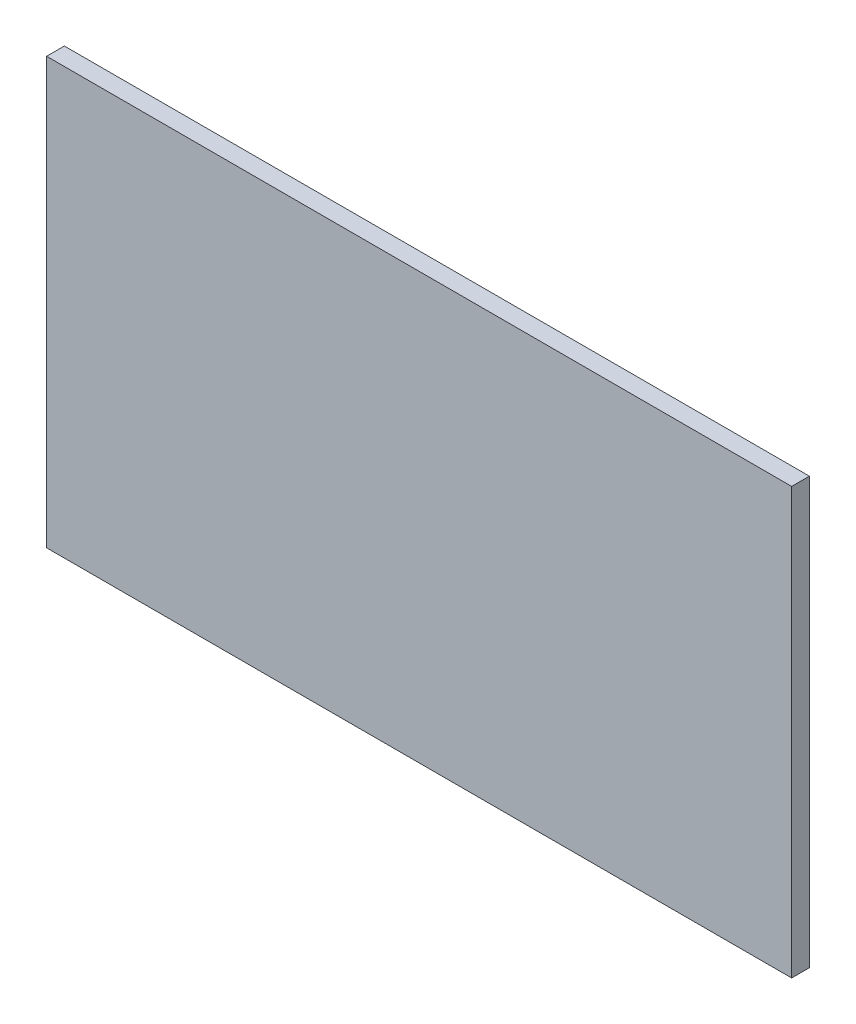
from build123d import *

# Parameters (mm, degrees)
SKETCH1_W           = 266.7
SKETCH1_H           = 152.4
BOSS_EXTRUDE1_DEPTH = 6.35


with BuildPart() as part:
    # Sketch1 → Boss-Extrude1 (new body)
    with BuildSketch(Plane.XY):
        Rectangle(SKETCH1_W, SKETCH1_H)
    extrude(amount=BOSS_EXTRUDE1_DEPTH)


solid = part.part
